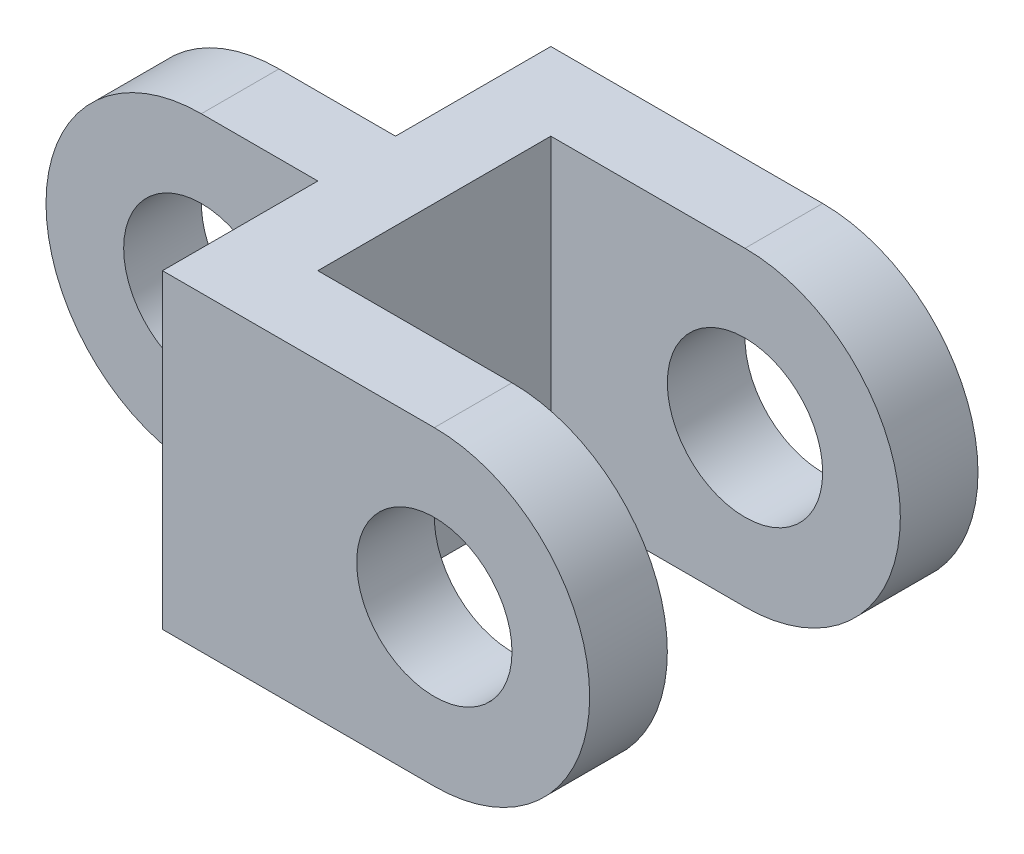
from build123d import *

# Parameters (mm, degrees)
EXTRUDE_1_DEPTH     = 40
FILLET_1_RADIUS     = 20
FILLET_1_LENGTH     = 10
FILLET_2_RADIUS     = 20
FILLET_2_LENGTH     = 10
FILLET_3_RADIUS     = 20
FILLET_3_LENGTH     = 10
SKETCH_3_R          = 10
CUT_EXTRUDE_1_DEPTH = 111.453610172


with BuildPart() as part:
    # Sketch 1 → Extrude 1 (new body)
    with BuildSketch(Plane(origin=(0, 0, 0), x_dir=(1, 0, 0), z_dir=(0, 1, 0))):
        Polygon((0, 30), (0, 20), (35, 20), (35, 0), (90, 0), (90, 10), (45, 10), (45, 40), (90, 40), (90, 50), (35, 50), (35, 30), align=None)
    extrude(amount=EXTRUDE_1_DEPTH)

    # Fillet 1: full round fillet: the end face becomes a half cylinder, R = half its width
    fillet_1_face = Plane((90, 20, -5), x_dir=(0, 0, -1), z_dir=(1, 0, 0))  # on the end face: x along it, z out of the body
    fillet_1_slab = fillet_1_face.offset(-FILLET_1_RADIUS / 2) * Box(FILLET_1_LENGTH, 2 * FILLET_1_RADIUS, FILLET_1_RADIUS, mode=Mode.PRIVATE)  # the body's end, R deep
    fillet_1_round = Plane((70, 20, -5), x_dir=(1, 0, 0), z_dir=(0, 0, -1)) * Cylinder(FILLET_1_RADIUS, FILLET_1_LENGTH, mode=Mode.PRIVATE)  # its axis R under the face
    add(fillet_1_slab - fillet_1_round, mode=Mode.SUBTRACT)

    # Fillet 2: full round fillet: the end face becomes a half cylinder, R = half its width
    fillet_2_face = Plane((90, 20, -45), x_dir=(0, 0, -1), z_dir=(1, 0, 0))  # on the end face: x along it, z out of the body
    fillet_2_slab = fillet_2_face.offset(-FILLET_2_RADIUS / 2) * Box(FILLET_2_LENGTH, 2 * FILLET_2_RADIUS, FILLET_2_RADIUS, mode=Mode.PRIVATE)  # the body's end, R deep
    fillet_2_round = Plane((70, 20, -45), x_dir=(1, 0, 0), z_dir=(0, 0, -1)) * Cylinder(FILLET_2_RADIUS, FILLET_2_LENGTH, mode=Mode.PRIVATE)  # its axis R under the face
    add(fillet_2_slab - fillet_2_round, mode=Mode.SUBTRACT)

    # Fillet 3: full round fillet: the end face becomes a half cylinder, R = half its width
    fillet_3_face = Plane((0, 20, -25), x_dir=(0, 0, 1), z_dir=(-1, 0, 0))  # on the end face: x along it, z out of the body
    fillet_3_slab = fillet_3_face.offset(-FILLET_3_RADIUS / 2) * Box(FILLET_3_LENGTH, 2 * FILLET_3_RADIUS, FILLET_3_RADIUS, mode=Mode.PRIVATE)  # the body's end, R deep
    fillet_3_round = Plane((20, 20, -25), x_dir=(-1, 0, 0), z_dir=(0, 0, 1)) * Cylinder(FILLET_3_RADIUS, FILLET_3_LENGTH, mode=Mode.PRIVATE)  # its axis R under the face
    add(fillet_3_slab - fillet_3_round, mode=Mode.SUBTRACT)

    # Sketch 3 → Cut-Extrude 1 (cut, through all)
    with BuildSketch(Plane.XY):
        with Locations((70, 20)):
            Circle(SKETCH_3_R)
        with Locations((20, 20)):
            Circle(SKETCH_3_R)
    extrude(amount=-CUT_EXTRUDE_1_DEPTH, mode=Mode.SUBTRACT)


solid = part.part
